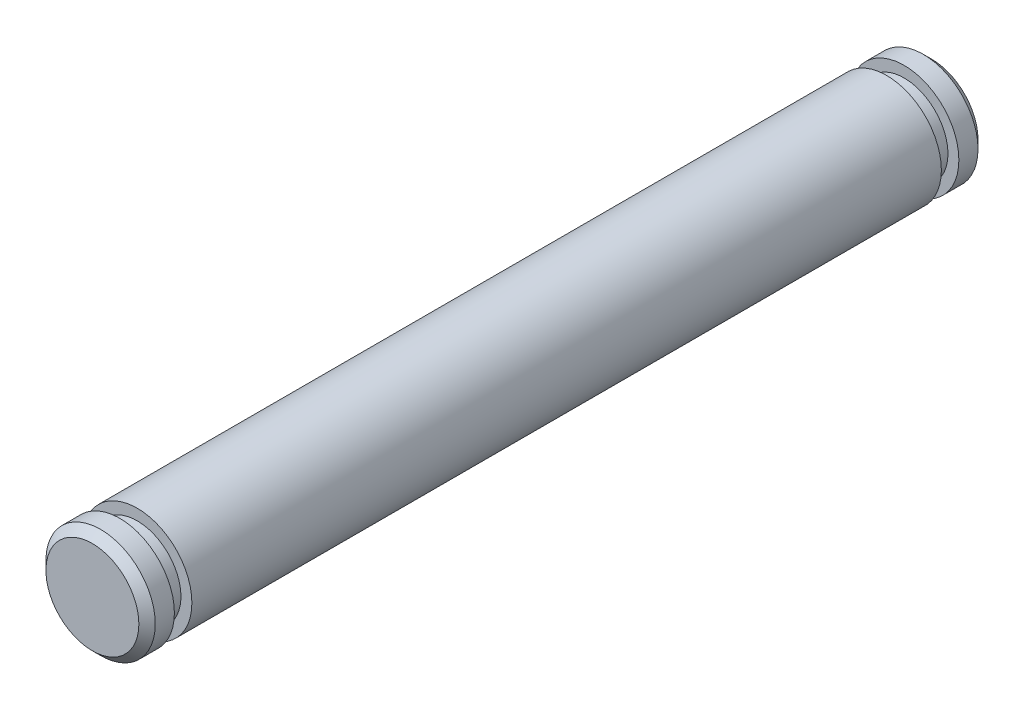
ISO-10303-21;
HEADER;
FILE_DESCRIPTION(('STEP AP214'),'2;1');
FILE_NAME('part.step','',(''),(''),'','','');
FILE_SCHEMA(('AUTOMOTIVE_DESIGN { 1 0 10303 214 1 1 1 1 }'));
ENDSEC;
DATA;
#1=APPLICATION_CONTEXT('core data for automotive mechanical design processes');
#2=APPLICATION_PROTOCOL_DEFINITION('international standard','automotive_design',2000,#1);
#3=PRODUCT_CONTEXT('',#1,'mechanical');
#4=PRODUCT('Part','Part','',(#3));
#5=PRODUCT_RELATED_PRODUCT_CATEGORY('part','',(#4));
#6=PRODUCT_DEFINITION_FORMATION('','',#4);
#7=PRODUCT_DEFINITION_CONTEXT('part definition',#1,'design');
#8=PRODUCT_DEFINITION('design','',#6,#7);
#9=PRODUCT_DEFINITION_SHAPE('','',#8);
#10=(LENGTH_UNIT() NAMED_UNIT(*) SI_UNIT(.MILLI.,.METRE.));
#11=(NAMED_UNIT(*) PLANE_ANGLE_UNIT() SI_UNIT($,.RADIAN.));
#12=(NAMED_UNIT(*) SI_UNIT($,.STERADIAN.) SOLID_ANGLE_UNIT());
#13=UNCERTAINTY_MEASURE_WITH_UNIT(LENGTH_MEASURE(1.E-05),#10,'distance_accuracy_value','');
#14=(GEOMETRIC_REPRESENTATION_CONTEXT(3) GLOBAL_UNCERTAINTY_ASSIGNED_CONTEXT((#13)) GLOBAL_UNIT_ASSIGNED_CONTEXT((#10,
#11,#12)) REPRESENTATION_CONTEXT('',''));
#15=CARTESIAN_POINT('',(0.,0.,0.));
#16=DIRECTION('',(0.,0.,1.));
#17=DIRECTION('',(1.,0.,0.));
#18=AXIS2_PLACEMENT_3D('',#15,#16,#17);
#19=CARTESIAN_POINT('',(0.,0.,30.7));
#20=DIRECTION('',(0.,0.,-1.));
#21=DIRECTION('',(-1.,0.,0.));
#22=AXIS2_PLACEMENT_3D('',#19,#20,#21);
#23=CYLINDRICAL_SURFACE('',#22,2.);
#24=CARTESIAN_POINT('',(0.,0.,29.7));
#25=DIRECTION('',(0.,0.,1.));
#26=DIRECTION('',(1.,0.,0.));
#27=AXIS2_PLACEMENT_3D('',#24,#25,#26);
#28=CIRCLE('',#27,2.);
#29=CARTESIAN_POINT('',(2.,0.,29.7));
#30=VERTEX_POINT('',#29);
#31=EDGE_CURVE('E51',#30,#30,#28,.T.);
#32=ORIENTED_EDGE('',*,*,#31,.T.);
#33=EDGE_LOOP('',(#32));
#34=FACE_BOUND('',#33,.T.);
#35=CARTESIAN_POINT('',(0.,0.,30.4));
#36=DIRECTION('',(0.,0.,1.));
#37=DIRECTION('',(1.,0.,0.));
#38=AXIS2_PLACEMENT_3D('',#35,#36,#37);
#39=CIRCLE('',#38,2.);
#40=CARTESIAN_POINT('',(2.,0.,30.4));
#41=VERTEX_POINT('',#40);
#42=EDGE_CURVE('E54',#41,#41,#39,.F.);
#43=ORIENTED_EDGE('',*,*,#42,.T.);
#44=EDGE_LOOP('',(#43));
#45=FACE_BOUND('',#44,.T.);
#46=ADVANCED_FACE('F31',(#34,#45),#23,.T.);
#47=CARTESIAN_POINT('',(0.,0.,30.7));
#48=DIRECTION('',(0.,0.,1.));
#49=DIRECTION('',(1.,0.,0.));
#50=AXIS2_PLACEMENT_3D('',#47,#48,#49);
#51=PLANE('',#50);
#52=CARTESIAN_POINT('',(0.,0.,30.7));
#53=DIRECTION('',(0.,0.,1.));
#54=DIRECTION('',(1.,0.,0.));
#55=AXIS2_PLACEMENT_3D('',#52,#53,#54);
#56=CIRCLE('',#55,1.69999999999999);
#57=CARTESIAN_POINT('',(1.69999999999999,0.,30.7));
#58=VERTEX_POINT('',#57);
#59=EDGE_CURVE('E10',#58,#58,#56,.T.);
#60=ORIENTED_EDGE('',*,*,#59,.T.);
#61=EDGE_LOOP('',(#60));
#62=FACE_BOUND('',#61,.T.);
#63=ADVANCED_FACE('F96',(#62),#51,.T.);
#64=CARTESIAN_POINT('',(0.,0.,30.7));
#65=DIRECTION('',(0.,0.,-1.));
#66=DIRECTION('',(-1.,0.,0.));
#67=AXIS2_PLACEMENT_3D('',#64,#65,#66);
#68=CONICAL_SURFACE('',#67,1.69999999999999,0.78539816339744);
#69=ORIENTED_EDGE('',*,*,#42,.F.);
#70=EDGE_LOOP('',(#69));
#71=FACE_BOUND('',#70,.T.);
#72=ORIENTED_EDGE('',*,*,#59,.F.);
#73=EDGE_LOOP('',(#72));
#74=FACE_BOUND('',#73,.T.);
#75=ADVANCED_FACE('F33',(#71,#74),#68,.T.);
#76=CARTESIAN_POINT('',(0.,0.,29.7));
#77=DIRECTION('',(0.,0.,1.));
#78=DIRECTION('',(1.,0.,0.));
#79=AXIS2_PLACEMENT_3D('',#76,#77,#78);
#80=PLANE('',#79);
#81=CARTESIAN_POINT('',(0.,0.,29.7));
#82=DIRECTION('',(0.,0.,1.));
#83=DIRECTION('',(1.,0.,0.));
#84=AXIS2_PLACEMENT_3D('',#81,#82,#83);
#85=CIRCLE('',#84,1.6);
#86=CARTESIAN_POINT('',(-1.6,0.,29.7));
#87=VERTEX_POINT('',#86);
#88=EDGE_CURVE('E52',#87,#87,#85,.T.);
#89=ORIENTED_EDGE('',*,*,#88,.T.);
#90=EDGE_LOOP('',(#89));
#91=FACE_BOUND('',#90,.T.);
#92=ORIENTED_EDGE('',*,*,#31,.F.);
#93=EDGE_LOOP('',(#92));
#94=FACE_BOUND('',#93,.T.);
#95=ADVANCED_FACE('F121',(#91,#94),#80,.F.);
#96=CARTESIAN_POINT('',(0.,0.,29.06));
#97=DIRECTION('',(0.,0.,1.));
#98=DIRECTION('',(1.,0.,0.));
#99=AXIS2_PLACEMENT_3D('',#96,#97,#98);
#100=PLANE('',#99);
#101=CARTESIAN_POINT('',(0.,0.,29.06));
#102=DIRECTION('',(0.,0.,1.));
#103=DIRECTION('',(1.,0.,0.));
#104=AXIS2_PLACEMENT_3D('',#101,#102,#103);
#105=CIRCLE('',#104,1.6);
#106=CARTESIAN_POINT('',(-1.6,0.,29.06));
#107=VERTEX_POINT('',#106);
#108=EDGE_CURVE('E61',#107,#107,#105,.T.);
#109=ORIENTED_EDGE('',*,*,#108,.F.);
#110=EDGE_LOOP('',(#109));
#111=FACE_BOUND('',#110,.T.);
#112=CARTESIAN_POINT('',(0.,0.,29.06));
#113=DIRECTION('',(0.,0.,1.));
#114=DIRECTION('',(1.,0.,0.));
#115=AXIS2_PLACEMENT_3D('',#112,#113,#114);
#116=CIRCLE('',#115,2.);
#117=CARTESIAN_POINT('',(2.,0.,29.06));
#118=VERTEX_POINT('',#117);
#119=EDGE_CURVE('E48',#118,#118,#116,.T.);
#120=ORIENTED_EDGE('',*,*,#119,.T.);
#121=EDGE_LOOP('',(#120));
#122=FACE_BOUND('',#121,.T.);
#123=ADVANCED_FACE('F113',(#111,#122),#100,.T.);
#124=CARTESIAN_POINT('',(0.,0.,29.7));
#125=DIRECTION('',(0.,0.,-1.));
#126=DIRECTION('',(-1.,0.,0.));
#127=AXIS2_PLACEMENT_3D('',#124,#125,#126);
#128=CYLINDRICAL_SURFACE('',#127,1.6);
#129=CARTESIAN_POINT('',(-1.6,0.,29.7));
#130=CARTESIAN_POINT('',(-1.6,0.,29.6933333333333));
#131=CARTESIAN_POINT('',(-1.6,0.,29.6866666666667));
#132=CARTESIAN_POINT('',(-1.6,0.,29.6733333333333));
#133=CARTESIAN_POINT('',(-1.6,0.,29.6666666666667));
#134=CARTESIAN_POINT('',(-1.6,0.,29.6533333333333));
#135=CARTESIAN_POINT('',(-1.6,0.,29.6466666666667));
#136=CARTESIAN_POINT('',(-1.6,0.,29.6333333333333));
#137=CARTESIAN_POINT('',(-1.6,0.,29.6266666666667));
#138=CARTESIAN_POINT('',(-1.6,0.,29.6133333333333));
#139=CARTESIAN_POINT('',(-1.6,0.,29.6066666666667));
#140=CARTESIAN_POINT('',(-1.6,0.,29.5933333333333));
#141=CARTESIAN_POINT('',(-1.6,0.,29.5866666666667));
#142=CARTESIAN_POINT('',(-1.6,0.,29.5733333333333));
#143=CARTESIAN_POINT('',(-1.6,0.,29.5666666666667));
#144=CARTESIAN_POINT('',(-1.6,0.,29.5533333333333));
#145=CARTESIAN_POINT('',(-1.6,0.,29.5466666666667));
#146=CARTESIAN_POINT('',(-1.6,0.,29.5333333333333));
#147=CARTESIAN_POINT('',(-1.6,0.,29.5266666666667));
#148=CARTESIAN_POINT('',(-1.6,0.,29.5133333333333));
#149=CARTESIAN_POINT('',(-1.6,0.,29.5066666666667));
#150=CARTESIAN_POINT('',(-1.6,0.,29.4933333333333));
#151=CARTESIAN_POINT('',(-1.6,0.,29.4866666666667));
#152=CARTESIAN_POINT('',(-1.6,0.,29.4733333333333));
#153=CARTESIAN_POINT('',(-1.6,0.,29.4666666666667));
#154=CARTESIAN_POINT('',(-1.6,0.,29.4533333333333));
#155=CARTESIAN_POINT('',(-1.6,0.,29.4466666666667));
#156=CARTESIAN_POINT('',(-1.6,0.,29.4333333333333));
#157=CARTESIAN_POINT('',(-1.6,0.,29.4266666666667));
#158=CARTESIAN_POINT('',(-1.6,0.,29.4133333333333));
#159=CARTESIAN_POINT('',(-1.6,0.,29.4066666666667));
#160=CARTESIAN_POINT('',(-1.6,0.,29.3933333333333));
#161=CARTESIAN_POINT('',(-1.6,0.,29.3866666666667));
#162=CARTESIAN_POINT('',(-1.6,0.,29.3733333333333));
#163=CARTESIAN_POINT('',(-1.6,0.,29.3666666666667));
#164=CARTESIAN_POINT('',(-1.6,0.,29.3533333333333));
#165=CARTESIAN_POINT('',(-1.6,0.,29.3466666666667));
#166=CARTESIAN_POINT('',(-1.6,0.,29.3333333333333));
#167=CARTESIAN_POINT('',(-1.6,0.,29.3266666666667));
#168=CARTESIAN_POINT('',(-1.6,0.,29.3133333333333));
#169=CARTESIAN_POINT('',(-1.6,0.,29.3066666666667));
#170=CARTESIAN_POINT('',(-1.6,0.,29.2933333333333));
#171=CARTESIAN_POINT('',(-1.6,0.,29.2866666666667));
#172=CARTESIAN_POINT('',(-1.6,0.,29.2733333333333));
#173=CARTESIAN_POINT('',(-1.6,0.,29.2666666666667));
#174=CARTESIAN_POINT('',(-1.6,0.,29.2533333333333));
#175=CARTESIAN_POINT('',(-1.6,0.,29.2466666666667));
#176=CARTESIAN_POINT('',(-1.6,0.,29.2333333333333));
#177=CARTESIAN_POINT('',(-1.6,0.,29.2266666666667));
#178=CARTESIAN_POINT('',(-1.6,0.,29.2133333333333));
#179=CARTESIAN_POINT('',(-1.6,0.,29.2066666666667));
#180=CARTESIAN_POINT('',(-1.6,0.,29.1933333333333));
#181=CARTESIAN_POINT('',(-1.6,0.,29.1866666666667));
#182=CARTESIAN_POINT('',(-1.6,0.,29.1733333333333));
#183=CARTESIAN_POINT('',(-1.6,0.,29.1666666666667));
#184=CARTESIAN_POINT('',(-1.6,0.,29.1533333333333));
#185=CARTESIAN_POINT('',(-1.6,0.,29.1466666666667));
#186=CARTESIAN_POINT('',(-1.6,0.,29.1333333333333));
#187=CARTESIAN_POINT('',(-1.6,0.,29.1266666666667));
#188=CARTESIAN_POINT('',(-1.6,0.,29.1133333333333));
#189=CARTESIAN_POINT('',(-1.6,0.,29.1066666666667));
#190=CARTESIAN_POINT('',(-1.6,0.,29.0933333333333));
#191=CARTESIAN_POINT('',(-1.6,0.,29.0866666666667));
#192=CARTESIAN_POINT('',(-1.6,0.,29.0733333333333));
#193=CARTESIAN_POINT('',(-1.6,0.,29.0666666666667));
#194=CARTESIAN_POINT('',(-1.6,0.,29.06));
#195=B_SPLINE_CURVE_WITH_KNOTS('',3,(#129,#130,#131,#132,#133,#134,#135,#136,#137,#138,#139,
#140,#141,#142,#143,#144,#145,#146,#147,#148,#149,#150,#151,#152,#153,#154,#155,#156,#157,#158,
#159,#160,#161,#162,#163,#164,#165,#166,#167,#168,#169,#170,#171,#172,#173,#174,#175,#176,#177,
#178,#179,#180,#181,#182,#183,#184,#185,#186,#187,#188,#189,#190,#191,#192,#193,#194),
.UNSPECIFIED.,.F.,.F.,(4,2,2,2,2,2,2,2,2,2,2,2,2,2,2,2,2,2,2,2,2,2,2,2,2,2,2,2,2,2,2,2,4),(0.,
0.0199999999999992,0.0399999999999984,0.0599999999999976,0.0799999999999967,0.0999999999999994,
0.119999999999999,0.139999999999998,0.159999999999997,0.18,0.199999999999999,0.219999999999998,
0.239999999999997,0.26,0.279999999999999,0.299999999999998,0.319999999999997,0.34,
0.359999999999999,0.379999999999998,0.399999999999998,0.42,0.439999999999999,0.459999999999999,
0.479999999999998,0.5,0.52,0.539999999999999,0.559999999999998,0.580000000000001,0.6,
0.619999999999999,0.639999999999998),.UNSPECIFIED.);
#196=EDGE_CURVE('BSEAM105',#87,#107,#195,.T.);
#197=ORIENTED_EDGE('',*,*,#88,.F.);
#198=ORIENTED_EDGE('',*,*,#108,.T.);
#199=ORIENTED_EDGE('',*,*,#196,.T.);
#200=ORIENTED_EDGE('',*,*,#196,.F.);
#201=EDGE_LOOP('',(#197,#199,#198,#200));
#202=FACE_BOUND('',#201,.T.);
#203=ADVANCED_FACE('F105',(#202),#128,.T.);
#204=CARTESIAN_POINT('',(0.,0.,1.64));
#205=DIRECTION('',(0.,0.,1.));
#206=DIRECTION('',(1.,0.,0.));
#207=AXIS2_PLACEMENT_3D('',#204,#205,#206);
#208=CIRCLE('',#207,2.);
#209=CARTESIAN_POINT('',(2.,0.,1.64));
#210=VERTEX_POINT('',#209);
#211=EDGE_CURVE('E35',#210,#210,#208,.T.);
#212=ORIENTED_EDGE('',*,*,#211,.T.);
#213=EDGE_LOOP('',(#212));
#214=FACE_BOUND('',#213,.T.);
#215=ORIENTED_EDGE('',*,*,#119,.F.);
#216=EDGE_LOOP('',(#215));
#217=FACE_BOUND('',#216,.T.);
#218=ADVANCED_FACE('F90',(#214,#217),#23,.T.);
#219=CARTESIAN_POINT('',(0.,0.,1.64));
#220=DIRECTION('',(0.,0.,1.));
#221=DIRECTION('',(1.,0.,0.));
#222=AXIS2_PLACEMENT_3D('',#219,#220,#221);
#223=PLANE('',#222);
#224=CARTESIAN_POINT('',(0.,0.,1.64));
#225=DIRECTION('',(0.,0.,1.));
#226=DIRECTION('',(1.,0.,0.));
#227=AXIS2_PLACEMENT_3D('',#224,#225,#226);
#228=CIRCLE('',#227,1.6);
#229=CARTESIAN_POINT('',(-1.6,0.,1.64));
#230=VERTEX_POINT('',#229);
#231=EDGE_CURVE('E57',#230,#230,#228,.T.);
#232=ORIENTED_EDGE('',*,*,#231,.T.);
#233=EDGE_LOOP('',(#232));
#234=FACE_BOUND('',#233,.T.);
#235=ORIENTED_EDGE('',*,*,#211,.F.);
#236=EDGE_LOOP('',(#235));
#237=FACE_BOUND('',#236,.T.);
#238=ADVANCED_FACE('F104',(#234,#237),#223,.F.);
#239=CARTESIAN_POINT('',(0.,0.,1.));
#240=DIRECTION('',(0.,0.,1.));
#241=DIRECTION('',(1.,0.,0.));
#242=AXIS2_PLACEMENT_3D('',#239,#240,#241);
#243=PLANE('',#242);
#244=CARTESIAN_POINT('',(0.,0.,1.));
#245=DIRECTION('',(0.,0.,1.));
#246=DIRECTION('',(1.,0.,0.));
#247=AXIS2_PLACEMENT_3D('',#244,#245,#246);
#248=CIRCLE('',#247,1.6);
#249=CARTESIAN_POINT('',(-1.6,0.,1.));
#250=VERTEX_POINT('',#249);
#251=EDGE_CURVE('E63',#250,#250,#248,.T.);
#252=ORIENTED_EDGE('',*,*,#251,.F.);
#253=EDGE_LOOP('',(#252));
#254=FACE_BOUND('',#253,.T.);
#255=CARTESIAN_POINT('',(0.,0.,1.));
#256=DIRECTION('',(0.,0.,1.));
#257=DIRECTION('',(1.,0.,0.));
#258=AXIS2_PLACEMENT_3D('',#255,#256,#257);
#259=CIRCLE('',#258,2.);
#260=CARTESIAN_POINT('',(2.,0.,1.));
#261=VERTEX_POINT('',#260);
#262=EDGE_CURVE('E55',#261,#261,#259,.T.);
#263=ORIENTED_EDGE('',*,*,#262,.T.);
#264=EDGE_LOOP('',(#263));
#265=FACE_BOUND('',#264,.T.);
#266=ADVANCED_FACE('F111',(#254,#265),#243,.T.);
#267=CARTESIAN_POINT('',(0.,0.,1.64));
#268=DIRECTION('',(0.,0.,-1.));
#269=DIRECTION('',(-1.,0.,0.));
#270=AXIS2_PLACEMENT_3D('',#267,#268,#269);
#271=CYLINDRICAL_SURFACE('',#270,1.6);
#272=CARTESIAN_POINT('',(-1.6,0.,1.64));
#273=CARTESIAN_POINT('',(-1.6,0.,1.63333333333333));
#274=CARTESIAN_POINT('',(-1.6,0.,1.62666666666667));
#275=CARTESIAN_POINT('',(-1.6,0.,1.61333333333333));
#276=CARTESIAN_POINT('',(-1.6,0.,1.60666666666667));
#277=CARTESIAN_POINT('',(-1.6,0.,1.59333333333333));
#278=CARTESIAN_POINT('',(-1.6,0.,1.58666666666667));
#279=CARTESIAN_POINT('',(-1.6,0.,1.57333333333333));
#280=CARTESIAN_POINT('',(-1.6,0.,1.56666666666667));
#281=CARTESIAN_POINT('',(-1.6,0.,1.55333333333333));
#282=CARTESIAN_POINT('',(-1.6,0.,1.54666666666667));
#283=CARTESIAN_POINT('',(-1.6,0.,1.53333333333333));
#284=CARTESIAN_POINT('',(-1.6,0.,1.52666666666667));
#285=CARTESIAN_POINT('',(-1.6,0.,1.51333333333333));
#286=CARTESIAN_POINT('',(-1.6,0.,1.50666666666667));
#287=CARTESIAN_POINT('',(-1.6,0.,1.49333333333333));
#288=CARTESIAN_POINT('',(-1.6,0.,1.48666666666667));
#289=CARTESIAN_POINT('',(-1.6,0.,1.47333333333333));
#290=CARTESIAN_POINT('',(-1.6,0.,1.46666666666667));
#291=CARTESIAN_POINT('',(-1.6,0.,1.45333333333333));
#292=CARTESIAN_POINT('',(-1.6,0.,1.44666666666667));
#293=CARTESIAN_POINT('',(-1.6,0.,1.43333333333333));
#294=CARTESIAN_POINT('',(-1.6,0.,1.42666666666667));
#295=CARTESIAN_POINT('',(-1.6,0.,1.41333333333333));
#296=CARTESIAN_POINT('',(-1.6,0.,1.40666666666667));
#297=CARTESIAN_POINT('',(-1.6,0.,1.39333333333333));
#298=CARTESIAN_POINT('',(-1.6,0.,1.38666666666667));
#299=CARTESIAN_POINT('',(-1.6,0.,1.37333333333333));
#300=CARTESIAN_POINT('',(-1.6,0.,1.36666666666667));
#301=CARTESIAN_POINT('',(-1.6,0.,1.35333333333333));
#302=CARTESIAN_POINT('',(-1.6,0.,1.34666666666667));
#303=CARTESIAN_POINT('',(-1.6,0.,1.33333333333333));
#304=CARTESIAN_POINT('',(-1.6,0.,1.32666666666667));
#305=CARTESIAN_POINT('',(-1.6,0.,1.31333333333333));
#306=CARTESIAN_POINT('',(-1.6,0.,1.30666666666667));
#307=CARTESIAN_POINT('',(-1.6,0.,1.29333333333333));
#308=CARTESIAN_POINT('',(-1.6,0.,1.28666666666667));
#309=CARTESIAN_POINT('',(-1.6,0.,1.27333333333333));
#310=CARTESIAN_POINT('',(-1.6,0.,1.26666666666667));
#311=CARTESIAN_POINT('',(-1.6,0.,1.25333333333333));
#312=CARTESIAN_POINT('',(-1.6,0.,1.24666666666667));
#313=CARTESIAN_POINT('',(-1.6,0.,1.23333333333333));
#314=CARTESIAN_POINT('',(-1.6,0.,1.22666666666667));
#315=CARTESIAN_POINT('',(-1.6,0.,1.21333333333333));
#316=CARTESIAN_POINT('',(-1.6,0.,1.20666666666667));
#317=CARTESIAN_POINT('',(-1.6,0.,1.19333333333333));
#318=CARTESIAN_POINT('',(-1.6,0.,1.18666666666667));
#319=CARTESIAN_POINT('',(-1.6,0.,1.17333333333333));
#320=CARTESIAN_POINT('',(-1.6,0.,1.16666666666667));
#321=CARTESIAN_POINT('',(-1.6,0.,1.15333333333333));
#322=CARTESIAN_POINT('',(-1.6,0.,1.14666666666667));
#323=CARTESIAN_POINT('',(-1.6,0.,1.13333333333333));
#324=CARTESIAN_POINT('',(-1.6,0.,1.12666666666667));
#325=CARTESIAN_POINT('',(-1.6,0.,1.11333333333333));
#326=CARTESIAN_POINT('',(-1.6,0.,1.10666666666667));
#327=CARTESIAN_POINT('',(-1.6,0.,1.09333333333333));
#328=CARTESIAN_POINT('',(-1.6,0.,1.08666666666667));
#329=CARTESIAN_POINT('',(-1.6,0.,1.07333333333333));
#330=CARTESIAN_POINT('',(-1.6,0.,1.06666666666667));
#331=CARTESIAN_POINT('',(-1.6,0.,1.05333333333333));
#332=CARTESIAN_POINT('',(-1.6,0.,1.04666666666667));
#333=CARTESIAN_POINT('',(-1.6,0.,1.03333333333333));
#334=CARTESIAN_POINT('',(-1.6,0.,1.02666666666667));
#335=CARTESIAN_POINT('',(-1.6,0.,1.01333333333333));
#336=CARTESIAN_POINT('',(-1.6,0.,1.00666666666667));
#337=CARTESIAN_POINT('',(-1.6,0.,1.));
#338=B_SPLINE_CURVE_WITH_KNOTS('',3,(#272,#273,#274,#275,#276,#277,#278,#279,#280,#281,#282,
#283,#284,#285,#286,#287,#288,#289,#290,#291,#292,#293,#294,#295,#296,#297,#298,#299,#300,#301,
#302,#303,#304,#305,#306,#307,#308,#309,#310,#311,#312,#313,#314,#315,#316,#317,#318,#319,#320,
#321,#322,#323,#324,#325,#326,#327,#328,#329,#330,#331,#332,#333,#334,#335,#336,#337),
.UNSPECIFIED.,.F.,.F.,(4,2,2,2,2,2,2,2,2,2,2,2,2,2,2,2,2,2,2,2,2,2,2,2,2,2,2,2,2,2,2,2,4),(0.,
0.0200000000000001,0.0400000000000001,0.0600000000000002,0.0800000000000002,0.1,0.12,0.14,0.16,
0.18,0.2,0.22,0.24,0.26,0.28,0.3,0.32,0.34,0.36,0.38,0.4,0.42,0.44,0.46,0.48,0.5,0.52,0.54,0.56,
0.58,0.6,0.62,0.64),.UNSPECIFIED.);
#339=EDGE_CURVE('BSEAM91',#230,#250,#338,.T.);
#340=ORIENTED_EDGE('',*,*,#231,.F.);
#341=ORIENTED_EDGE('',*,*,#251,.T.);
#342=ORIENTED_EDGE('',*,*,#339,.T.);
#343=ORIENTED_EDGE('',*,*,#339,.F.);
#344=EDGE_LOOP('',(#340,#342,#341,#343));
#345=FACE_BOUND('',#344,.T.);
#346=ADVANCED_FACE('F91',(#345),#271,.T.);
#347=CARTESIAN_POINT('',(0.,0.,0.));
#348=DIRECTION('',(0.,0.,1.));
#349=DIRECTION('',(1.,0.,0.));
#350=AXIS2_PLACEMENT_3D('',#347,#348,#349);
#351=PLANE('',#350);
#352=CARTESIAN_POINT('',(0.,0.,0.));
#353=DIRECTION('',(0.,0.,1.));
#354=DIRECTION('',(1.,0.,0.));
#355=AXIS2_PLACEMENT_3D('',#352,#353,#354);
#356=CIRCLE('',#355,1.7);
#357=CARTESIAN_POINT('',(1.7,0.,0.));
#358=VERTEX_POINT('',#357);
#359=EDGE_CURVE('E39',#358,#358,#356,.F.);
#360=ORIENTED_EDGE('',*,*,#359,.T.);
#361=EDGE_LOOP('',(#360));
#362=FACE_BOUND('',#361,.T.);
#363=ADVANCED_FACE('F83',(#362),#351,.F.);
#364=CARTESIAN_POINT('',(0.,0.,0.300000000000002));
#365=DIRECTION('',(0.,0.,1.));
#366=DIRECTION('',(1.,0.,0.));
#367=AXIS2_PLACEMENT_3D('',#364,#365,#366);
#368=CONICAL_SURFACE('',#367,2.,0.785398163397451);
#369=ORIENTED_EDGE('',*,*,#359,.F.);
#370=EDGE_LOOP('',(#369));
#371=FACE_BOUND('',#370,.T.);
#372=CARTESIAN_POINT('',(0.,0.,0.300000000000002));
#373=DIRECTION('',(0.,0.,1.));
#374=DIRECTION('',(1.,0.,0.));
#375=AXIS2_PLACEMENT_3D('',#372,#373,#374);
#376=CIRCLE('',#375,2.);
#377=CARTESIAN_POINT('',(2.,0.,0.300000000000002));
#378=VERTEX_POINT('',#377);
#379=EDGE_CURVE('E44',#378,#378,#376,.T.);
#380=ORIENTED_EDGE('',*,*,#379,.F.);
#381=EDGE_LOOP('',(#380));
#382=FACE_BOUND('',#381,.T.);
#383=ADVANCED_FACE('F81',(#371,#382),#368,.T.);
#384=ORIENTED_EDGE('',*,*,#379,.T.);
#385=EDGE_LOOP('',(#384));
#386=FACE_BOUND('',#385,.T.);
#387=ORIENTED_EDGE('',*,*,#262,.F.);
#388=EDGE_LOOP('',(#387));
#389=FACE_BOUND('',#388,.T.);
#390=ADVANCED_FACE('F78',(#386,#389),#23,.T.);
#391=CLOSED_SHELL('',(#46,#63,#75,#95,#123,#203,#218,#238,#266,#346,#363,#383,#390));
#392=MANIFOLD_SOLID_BREP('B2',#391);
#393=ADVANCED_BREP_SHAPE_REPRESENTATION('',(#18,#392),#14);
#394=SHAPE_DEFINITION_REPRESENTATION(#9,#393);
ENDSEC;
END-ISO-10303-21;
